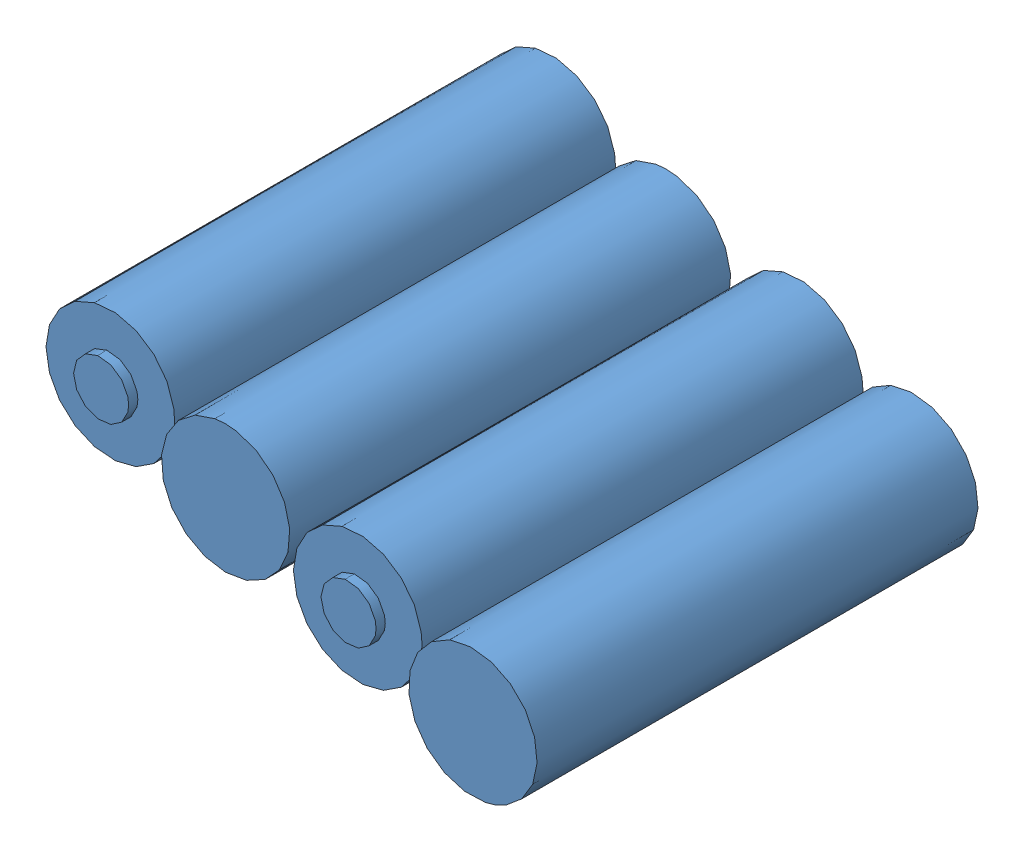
SolidWorks assembly Assemblage1.sldasm, configuration Défaut (file format 3100). Lengths in mm.
Overall size (56.52 27.24 49).
4 component instances, 1 part files, 6 mates.
Components (placement in the parent):
- 60D_Batterie-1: 60D_Batterie.SLDPRT [Défaut] at (4.0342 -16.5553 -41.296) size (14 14 49)
- 60D_Batterie-2: 60D_Batterie.SLDPRT [Défaut] at (-22.9015 -8.9365 -41.296) size (14 14 49)
- 60D_Batterie-3: 60D_Batterie.SLDPRT [Défaut] at (-9.3455 -12.434 7.704) x (0 1 0) z (0 0 -1) size (14 14 49)
- 60D_Batterie-4: 60D_Batterie.SLDPRT [Défaut] at (17.5704 -20.1288 7.704) x (0.360025 -0.932943 0) z (0 0 -1) size (14 14 49)
Mates (geometry in assembly coordinates):
- Tangent1: tangent anti-aligned: cylinder of 60D_Batterie-2; cylinder of 60D_Batterie-3
- Coïncidente2: coincident aligned: plane of 60D_Batterie-2 through (-22.9015 -8.9365 -41.296) normal (0 0 -1); plane of 60D_Batterie-3 through (-9.3455 -12.434 -41.296) normal (0 0 -1)
- Tangent2: tangent anti-aligned: cylinder of 60D_Batterie-1; cylinder of 60D_Batterie-3
- Coïncidente3: coincident aligned: plane of 60D_Batterie-1 through (4.0342 -16.5553 7.704) normal (0 0 1); plane of 60D_Batterie-3 through (-9.3455 -12.434 7.704) normal (0 0 1)
- Tangent4: tangent: cylinder of 60D_Batterie-1; cylinder of 60D_Batterie-4
- Coïncidente4: coincident aligned: plane of 60D_Batterie-1 through (4.0342 -16.5553 7.704) normal (0 0 1); plane of 60D_Batterie-4 through (17.5704 -20.1288 7.704) normal (0 0 1)
